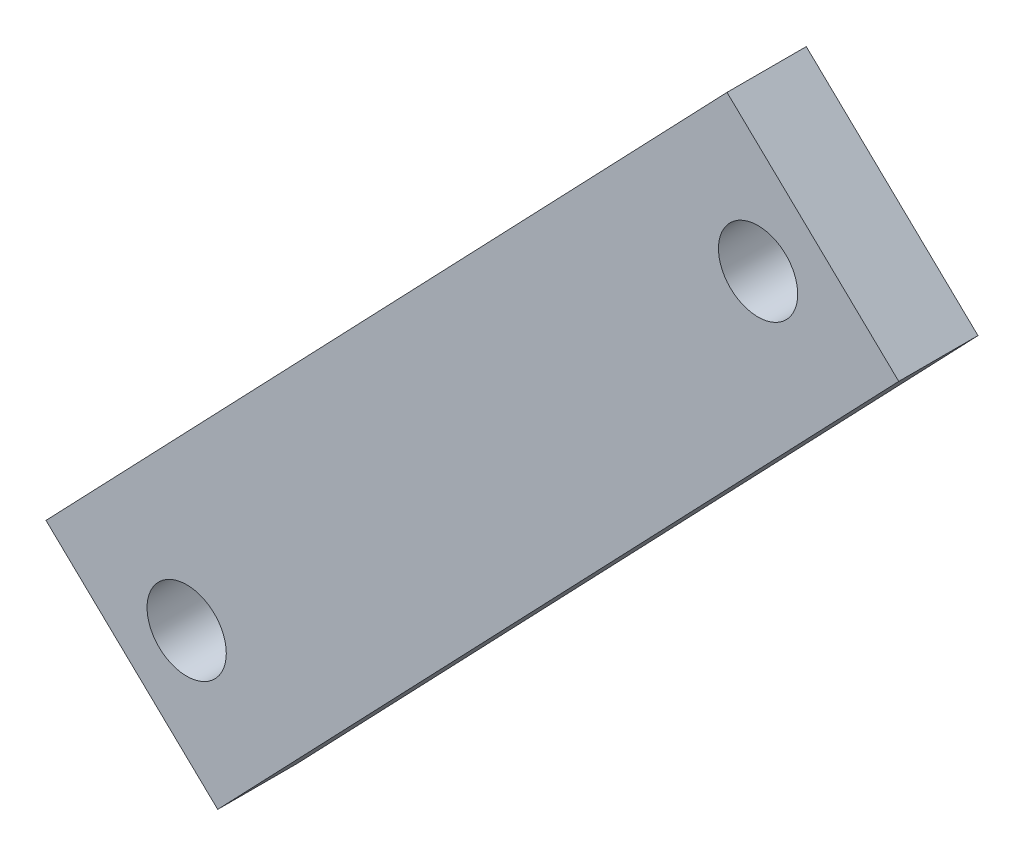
from build123d import *

# Parameters (mm, degrees)
SKIZZE1_R               = 5
LINEAR_AUSTRAGEN1_DEPTH = 10


with BuildPart() as part:
    # Skizze1 → Linear austragen1 (new body)
    with BuildSketch(Plane.XY):
        Polygon((-128.859268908, 624.309950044), (-42.928689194, 714.049462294), (-21.260627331, 693.301086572), (-107.191207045, 603.561574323), align=None)
        with Locations((-111.109112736, 621.158449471)):
            Circle(SKIZZE1_R, mode=Mode.SUBTRACT)
        with Locations((-39.010783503, 696.452587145)):
            Circle(SKIZZE1_R, mode=Mode.SUBTRACT)
    extrude(amount=LINEAR_AUSTRAGEN1_DEPTH)


solid = part.part
